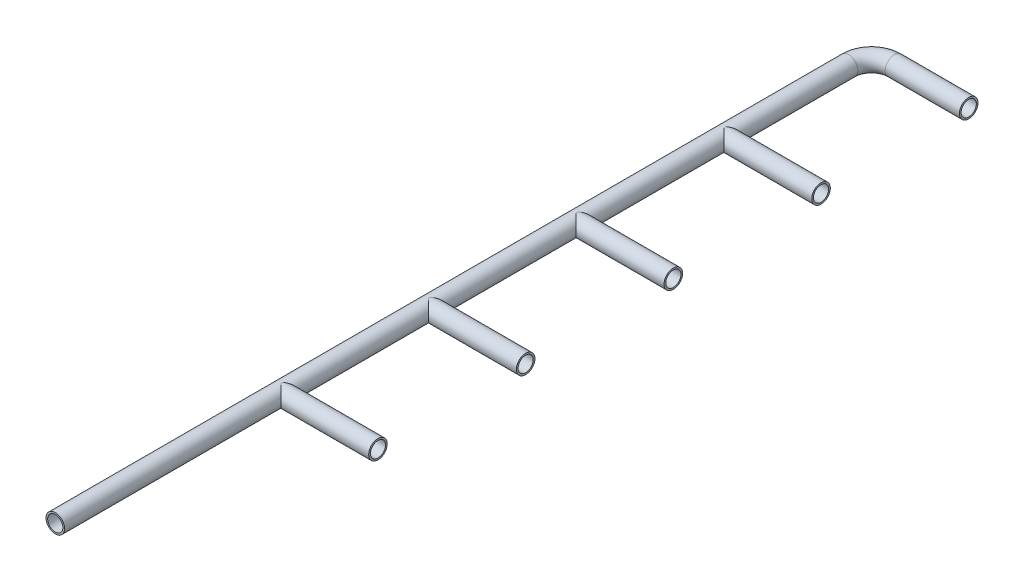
from build123d import *
from build123d.topology import SkipClean

# Parameters (mm, degrees)
SCHIZZO1_R                     = 5.5
SCHIZZO1_R_2                   = 4.5
ESTRUSIONE_ESTRUSIONE1_DEPTH   = 44
ESTRUSIONE_ESTRUSIONE1_2_DEPTH = 44
ESTRUSIONE_ESTRUSIONE1_3_DEPTH = 44
ESTRUSIONE_ESTRUSIONE1_4_DEPTH = 44
ESTRUSIONE_ESTRUSIONE1_5_DEPTH = 44
SCHIZZO2_R                     = 5.5
SCHIZZO2_R_2                   = 4.5
RIVOLUZIONE1_ANGLE             = 90
SCHIZZO3_R                     = 5.5
SCHIZZO3_R_2                   = 4.5
ESTRUSIONE_ESTRUSIONE2_DEPTH   = 470
SCHIZZO1_3_R                   = 5.5
SCHIZZO1_3_R_2                 = 4.5
ESTRUSIONE_ESTRUSIONE3_DEPTH   = 13
SCHIZZO4_R                     = 5.5
SCHIZZO4_R_2                   = 4.5
ESTRUSIONE_ESTRUSIONE4_DEPTH   = 5


with BuildPart() as part:
    # Schizzo1 → Estrusione-Estrusione1 (new body)
    with BuildSketch(Plane(origin=(0, 0, 0), x_dir=(0, 0, -1), z_dir=(1, 0, 0))):
        with Locations((87.5, 0)):
            Circle(SCHIZZO1_R)
        with Locations((87.5, 0)):
            Circle(SCHIZZO1_R_2, mode=Mode.SUBTRACT)
    extrude(amount=ESTRUSIONE_ESTRUSIONE1_DEPTH)

    # Schizzo2 → Rivoluzione1 (revolve)
    with BuildSketch(Plane.ZY):
        with Locations(Location((-87.5, 0, 0), (0, 0, 180))):
            Circle(SCHIZZO2_R)
        with Locations(Location((-87.5, 0, 0), (0, 0, 180))):
            Circle(SCHIZZO2_R_2, mode=Mode.SUBTRACT)
    revolve(axis=Axis((0, -5.5, -73.905487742), (0, 1, 0)), revolution_arc=RIVOLUZIONE1_ANGLE)

    # Schizzo3 → Estrusione-Estrusione2 (add)
    with BuildSketch(Plane.XY.offset(-73.905487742)):
        with Locations(Location((-13.594512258, 0, 0), (0, 0, 180))):
            Circle(SCHIZZO3_R)
        with Locations(Location((-13.594512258, 0, 0), (0, 0, 180))):
            Circle(SCHIZZO3_R_2, mode=Mode.SUBTRACT)
    extrude(amount=ESTRUSIONE_ESTRUSIONE2_DEPTH)


with BuildPart() as body_2:
    # Schizzo1 → Estrusione-Estrusione1 2 (new body)
    with BuildSketch(Plane(origin=(0, 0, 0), x_dir=(0, 0, -1), z_dir=(1, 0, 0))):
        with Locations((-87.5, 0)):
            Circle(SCHIZZO1_R)
        with Locations((-87.5, 0)):
            Circle(SCHIZZO1_R_2, mode=Mode.SUBTRACT)
    extrude(amount=ESTRUSIONE_ESTRUSIONE1_2_DEPTH)


with BuildPart() as body_3:
    # Schizzo1 → Estrusione-Estrusione1 3 (new body)
    with BuildSketch(Plane(origin=(0, 0, 0), x_dir=(0, 0, -1), z_dir=(1, 0, 0))):
        with Locations((-175, 0)):
            Circle(SCHIZZO1_R)
        with Locations((-175, 0)):
            Circle(SCHIZZO1_R_2, mode=Mode.SUBTRACT)
    extrude(amount=ESTRUSIONE_ESTRUSIONE1_3_DEPTH)



with BuildPart() as body_4:
    # Schizzo1 → Estrusione-Estrusione1 4 (new body)
    with BuildSketch(Plane(origin=(0, 0, 0), x_dir=(0, 0, -1), z_dir=(1, 0, 0))):
        Circle(SCHIZZO1_R)
        Circle(SCHIZZO1_R_2, mode=Mode.SUBTRACT)
    extrude(amount=ESTRUSIONE_ESTRUSIONE1_4_DEPTH)


with BuildPart() as body_5:
    # Schizzo1 → Estrusione-Estrusione1 5 (new body)
    with BuildSketch(Plane(origin=(0, 0, 0), x_dir=(0, 0, -1), z_dir=(1, 0, 0))):
        with Locations((-262.5, 0)):
            Circle(SCHIZZO1_R)
        with Locations((-262.5, 0)):
            Circle(SCHIZZO1_R_2, mode=Mode.SUBTRACT)
    extrude(amount=ESTRUSIONE_ESTRUSIONE1_5_DEPTH)


    with SkipClean():  # the faces are left unmerged after this step: merging them gives an invalid solid
        add(part.part)  # Estrusione-Estrusione3 merges part

        add(body_2.part)  # Estrusione-Estrusione3 merges body 2

        add(body_4.part)  # Estrusione-Estrusione3 merges body 4
        # Schizzo1_3 → Estrusione-Estrusione3 (add)
        # profile 1 of 4: a face of its own
        with BuildSketch(Plane(origin=(0, 0, 0), x_dir=(0, 0, -1), z_dir=(1, 0, 0))):
            with Locations((-87.5, 0)):
                Circle(SCHIZZO1_3_R)
            with Locations((-87.5, 0)):
                Circle(SCHIZZO1_3_R_2, mode=Mode.SUBTRACT)
        # profile 2 of 4: a face of its own
        with BuildSketch(Plane(origin=(0, 0, 0), x_dir=(0, 0, -1), z_dir=(1, 0, 0))):
            Circle(SCHIZZO1_3_R)
            Circle(SCHIZZO1_3_R_2, mode=Mode.SUBTRACT)
        # profile 3 of 4: a face of its own
        with BuildSketch(Plane(origin=(0, 0, 0), x_dir=(0, 0, -1), z_dir=(1, 0, 0))):
            with Locations((-175, 0)):
                Circle(SCHIZZO1_3_R)
            with Locations((-175, 0)):
                Circle(SCHIZZO1_3_R_2, mode=Mode.SUBTRACT)
        # profile 4 of 4: a face of its own
        with BuildSketch(Plane(origin=(0, 0, 0), x_dir=(0, 0, -1), z_dir=(1, 0, 0))):
            with Locations(Location((-262.5, 0, 0), (0, 0, 263.794595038))):
                Circle(SCHIZZO1_3_R)
            with Locations(Location((-262.5, 0, 0), (0, 0, 180))):
                Circle(SCHIZZO1_3_R_2, mode=Mode.SUBTRACT)
        extrude(amount=-ESTRUSIONE_ESTRUSIONE3_DEPTH)


with BuildPart() as body_3_1:
    with SkipClean():  # the faces are left unmerged after this step: merging them gives an invalid solid
        add(body_3.part)

        add(body_5.part)  # Estrusione-Estrusione4 merges body 5
        # Schizzo4 → Estrusione-Estrusione4 (add)
        with BuildSketch(Plane.ZY):
            with Locations(Location((175, 0, 0), (0, 0, 276.205404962))):
                Circle(SCHIZZO4_R)
            with Locations(Location((175, 0, 0), (0, 0, 180))):
                Circle(SCHIZZO4_R_2, mode=Mode.SUBTRACT)
        extrude(amount=ESTRUSIONE_ESTRUSIONE4_DEPTH)


solid = body_3_1.part
